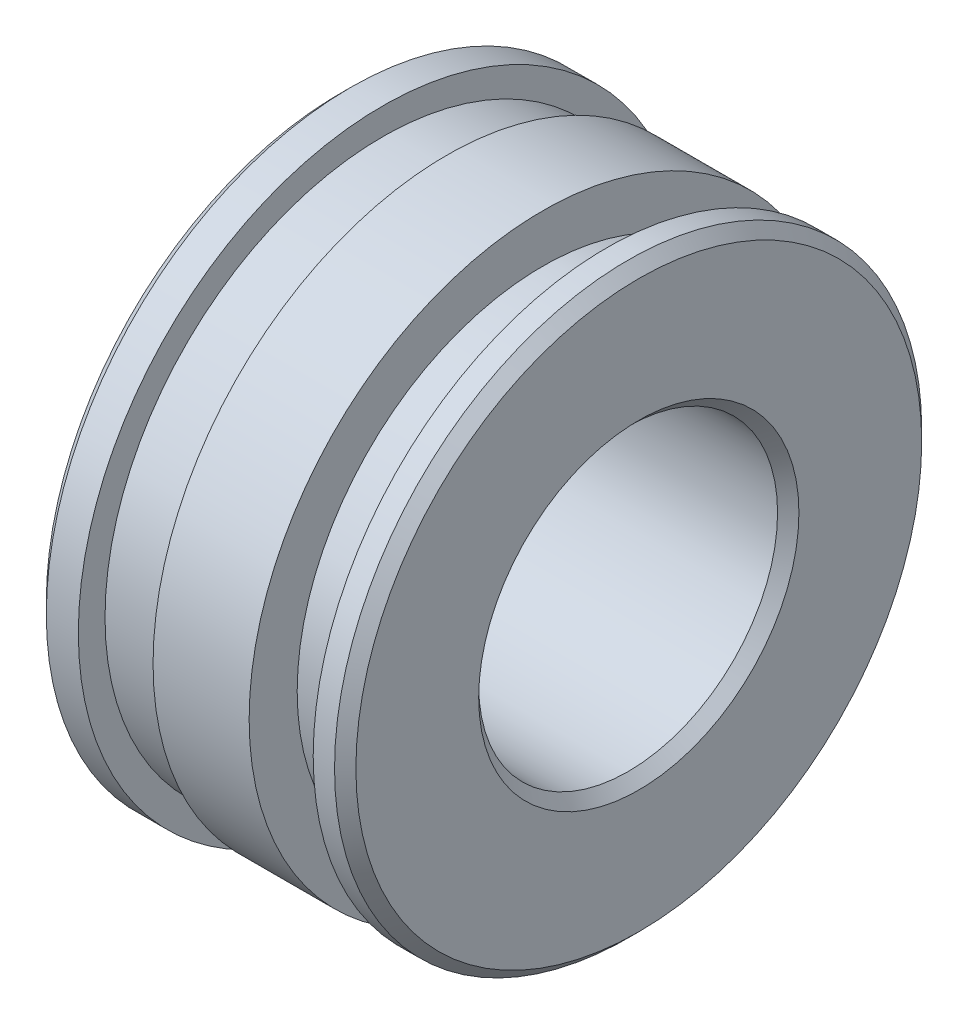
ISO-10303-21;
HEADER;
FILE_DESCRIPTION(('STEP AP214'),'2;1');
FILE_NAME('part.step','',(''),(''),'','','');
FILE_SCHEMA(('AUTOMOTIVE_DESIGN { 1 0 10303 214 1 1 1 1 }'));
ENDSEC;
DATA;
#1=APPLICATION_CONTEXT('core data for automotive mechanical design processes');
#2=APPLICATION_PROTOCOL_DEFINITION('international standard','automotive_design',2000,#1);
#3=PRODUCT_CONTEXT('',#1,'mechanical');
#4=PRODUCT('Part','Part','',(#3));
#5=PRODUCT_RELATED_PRODUCT_CATEGORY('part','',(#4));
#6=PRODUCT_DEFINITION_FORMATION('','',#4);
#7=PRODUCT_DEFINITION_CONTEXT('part definition',#1,'design');
#8=PRODUCT_DEFINITION('design','',#6,#7);
#9=PRODUCT_DEFINITION_SHAPE('','',#8);
#10=(LENGTH_UNIT() NAMED_UNIT(*) SI_UNIT(.MILLI.,.METRE.));
#11=(NAMED_UNIT(*) PLANE_ANGLE_UNIT() SI_UNIT($,.RADIAN.));
#12=(NAMED_UNIT(*) SI_UNIT($,.STERADIAN.) SOLID_ANGLE_UNIT());
#13=UNCERTAINTY_MEASURE_WITH_UNIT(LENGTH_MEASURE(1.E-05),#10,'distance_accuracy_value','');
#14=(GEOMETRIC_REPRESENTATION_CONTEXT(3) GLOBAL_UNCERTAINTY_ASSIGNED_CONTEXT((#13)) GLOBAL_UNIT_ASSIGNED_CONTEXT((#10,
#11,#12)) REPRESENTATION_CONTEXT('',''));
#15=CARTESIAN_POINT('',(0.,0.,0.));
#16=DIRECTION('',(0.,0.,1.));
#17=DIRECTION('',(1.,0.,0.));
#18=AXIS2_PLACEMENT_3D('',#15,#16,#17);
#19=CARTESIAN_POINT('',(10.,27.5,0.));
#20=DIRECTION('',(1.,0.,0.));
#21=DIRECTION('',(0.,0.,-1.));
#22=AXIS2_PLACEMENT_3D('',#19,#20,#21);
#23=PLANE('',#22);
#24=CARTESIAN_POINT('',(10.,0.,0.));
#25=DIRECTION('',(-1.,0.,0.));
#26=DIRECTION('',(0.,0.,1.));
#27=AXIS2_PLACEMENT_3D('',#24,#25,#26);
#28=CIRCLE('',#27,26.);
#29=CARTESIAN_POINT('',(10.,0.,26.));
#30=VERTEX_POINT('',#29);
#31=EDGE_CURVE('E84',#30,#30,#28,.T.);
#32=ORIENTED_EDGE('',*,*,#31,.F.);
#33=EDGE_LOOP('',(#32));
#34=FACE_BOUND('',#33,.T.);
#35=CARTESIAN_POINT('',(10.,0.,0.));
#36=DIRECTION('',(-1.,0.,0.));
#37=DIRECTION('',(0.,0.,1.));
#38=AXIS2_PLACEMENT_3D('',#35,#36,#37);
#39=CIRCLE('',#38,27.5);
#40=CARTESIAN_POINT('',(10.,0.,27.5));
#41=VERTEX_POINT('',#40);
#42=EDGE_CURVE('E63',#41,#41,#39,.T.);
#43=ORIENTED_EDGE('',*,*,#42,.T.);
#44=EDGE_LOOP('',(#43));
#45=FACE_BOUND('',#44,.T.);
#46=ADVANCED_FACE('F31',(#34,#45),#23,.F.);
#47=CARTESIAN_POINT('',(-19.2479883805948,0.,0.));
#48=DIRECTION('',(-1.,0.,0.));
#49=DIRECTION('',(0.,0.,1.));
#50=AXIS2_PLACEMENT_3D('',#47,#48,#49);
#51=CYLINDRICAL_SURFACE('',#50,27.5);
#52=ORIENTED_EDGE('',*,*,#42,.F.);
#53=EDGE_LOOP('',(#52));
#54=FACE_BOUND('',#53,.T.);
#55=CARTESIAN_POINT('',(19.,0.,0.));
#56=DIRECTION('',(-1.,0.,0.));
#57=DIRECTION('',(0.,0.,1.));
#58=AXIS2_PLACEMENT_3D('',#55,#56,#57);
#59=CIRCLE('',#58,27.5);
#60=CARTESIAN_POINT('',(19.,0.,27.5));
#61=VERTEX_POINT('',#60);
#62=EDGE_CURVE('E66',#61,#61,#59,.T.);
#63=ORIENTED_EDGE('',*,*,#62,.T.);
#64=EDGE_LOOP('',(#63));
#65=FACE_BOUND('',#64,.T.);
#66=ADVANCED_FACE('F92',(#54,#65),#51,.T.);
#67=CARTESIAN_POINT('',(19.,23.,0.));
#68=DIRECTION('',(-1.,0.,0.));
#69=DIRECTION('',(0.,0.,1.));
#70=AXIS2_PLACEMENT_3D('',#67,#68,#69);
#71=PLANE('',#70);
#72=ORIENTED_EDGE('',*,*,#62,.F.);
#73=EDGE_LOOP('',(#72));
#74=FACE_BOUND('',#73,.T.);
#75=CARTESIAN_POINT('',(19.,0.,0.));
#76=DIRECTION('',(-1.,0.,0.));
#77=DIRECTION('',(0.,0.,1.));
#78=AXIS2_PLACEMENT_3D('',#75,#76,#77);
#79=CIRCLE('',#78,23.);
#80=CARTESIAN_POINT('',(19.,0.,23.));
#81=VERTEX_POINT('',#80);
#82=EDGE_CURVE('E69',#81,#81,#79,.T.);
#83=ORIENTED_EDGE('',*,*,#82,.T.);
#84=EDGE_LOOP('',(#83));
#85=FACE_BOUND('',#84,.T.);
#86=ADVANCED_FACE('F98',(#74,#85),#71,.F.);
#87=CARTESIAN_POINT('',(-19.2479883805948,0.,0.));
#88=DIRECTION('',(-1.,0.,0.));
#89=DIRECTION('',(0.,0.,1.));
#90=AXIS2_PLACEMENT_3D('',#87,#88,#89);
#91=CYLINDRICAL_SURFACE('',#90,23.);
#92=ORIENTED_EDGE('',*,*,#82,.F.);
#93=EDGE_LOOP('',(#92));
#94=FACE_BOUND('',#93,.T.);
#95=CARTESIAN_POINT('',(25.,0.,0.));
#96=DIRECTION('',(-1.,0.,0.));
#97=DIRECTION('',(0.,0.,1.));
#98=AXIS2_PLACEMENT_3D('',#95,#96,#97);
#99=CIRCLE('',#98,23.);
#100=CARTESIAN_POINT('',(25.,0.,23.));
#101=VERTEX_POINT('',#100);
#102=EDGE_CURVE('E72',#101,#101,#99,.T.);
#103=ORIENTED_EDGE('',*,*,#102,.T.);
#104=EDGE_LOOP('',(#103));
#105=FACE_BOUND('',#104,.T.);
#106=ADVANCED_FACE('F104',(#94,#105),#91,.T.);
#107=CARTESIAN_POINT('',(25.,27.5,0.));
#108=DIRECTION('',(1.,0.,0.));
#109=DIRECTION('',(0.,0.,-1.));
#110=AXIS2_PLACEMENT_3D('',#107,#108,#109);
#111=PLANE('',#110);
#112=ORIENTED_EDGE('',*,*,#102,.F.);
#113=EDGE_LOOP('',(#112));
#114=FACE_BOUND('',#113,.T.);
#115=CARTESIAN_POINT('',(25.,0.,0.));
#116=DIRECTION('',(-1.,0.,0.));
#117=DIRECTION('',(0.,0.,1.));
#118=AXIS2_PLACEMENT_3D('',#115,#116,#117);
#119=CIRCLE('',#118,27.5);
#120=CARTESIAN_POINT('',(25.,0.,27.5));
#121=VERTEX_POINT('',#120);
#122=EDGE_CURVE('E75',#121,#121,#119,.T.);
#123=ORIENTED_EDGE('',*,*,#122,.T.);
#124=EDGE_LOOP('',(#123));
#125=FACE_BOUND('',#124,.T.);
#126=ADVANCED_FACE('F110',(#114,#125),#111,.F.);
#127=CARTESIAN_POINT('',(-19.2479883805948,0.,0.));
#128=DIRECTION('',(-1.,0.,0.));
#129=DIRECTION('',(0.,0.,1.));
#130=AXIS2_PLACEMENT_3D('',#127,#128,#129);
#131=CYLINDRICAL_SURFACE('',#130,27.5);
#132=CARTESIAN_POINT('',(27.,0.,0.));
#133=DIRECTION('',(-1.,0.,0.));
#134=DIRECTION('',(0.,0.,1.));
#135=AXIS2_PLACEMENT_3D('',#132,#133,#134);
#136=CIRCLE('',#135,27.5);
#137=CARTESIAN_POINT('',(27.,0.,27.5));
#138=VERTEX_POINT('',#137);
#139=EDGE_CURVE('E46',#138,#138,#136,.T.);
#140=ORIENTED_EDGE('',*,*,#139,.T.);
#141=EDGE_LOOP('',(#140));
#142=FACE_BOUND('',#141,.T.);
#143=ORIENTED_EDGE('',*,*,#122,.F.);
#144=EDGE_LOOP('',(#143));
#145=FACE_BOUND('',#144,.T.);
#146=ADVANCED_FACE('F116',(#142,#145),#131,.T.);
#147=CARTESIAN_POINT('',(28.,14.,0.));
#148=DIRECTION('',(-1.,0.,0.));
#149=DIRECTION('',(0.,0.,1.));
#150=AXIS2_PLACEMENT_3D('',#147,#148,#149);
#151=PLANE('',#150);
#152=CARTESIAN_POINT('',(28.,0.,0.));
#153=DIRECTION('',(-1.,0.,0.));
#154=DIRECTION('',(0.,0.,1.));
#155=AXIS2_PLACEMENT_3D('',#152,#153,#154);
#156=CIRCLE('',#155,15.);
#157=CARTESIAN_POINT('',(28.,0.,15.));
#158=VERTEX_POINT('',#157);
#159=EDGE_CURVE('E57',#158,#158,#156,.T.);
#160=ORIENTED_EDGE('',*,*,#159,.T.);
#161=EDGE_LOOP('',(#160));
#162=FACE_BOUND('',#161,.T.);
#163=CARTESIAN_POINT('',(28.,0.,0.));
#164=DIRECTION('',(-1.,0.,0.));
#165=DIRECTION('',(0.,0.,1.));
#166=AXIS2_PLACEMENT_3D('',#163,#164,#165);
#167=CIRCLE('',#166,26.5);
#168=CARTESIAN_POINT('',(28.,0.,26.5));
#169=VERTEX_POINT('',#168);
#170=EDGE_CURVE('E60',#169,#169,#167,.F.);
#171=ORIENTED_EDGE('',*,*,#170,.T.);
#172=EDGE_LOOP('',(#171));
#173=FACE_BOUND('',#172,.T.);
#174=ADVANCED_FACE('F121',(#162,#173),#151,.F.);
#175=CARTESIAN_POINT('',(-19.2479883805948,0.,0.));
#176=DIRECTION('',(-1.,0.,0.));
#177=DIRECTION('',(0.,0.,1.));
#178=AXIS2_PLACEMENT_3D('',#175,#176,#177);
#179=CYLINDRICAL_SURFACE('',#178,14.);
#180=CARTESIAN_POINT('',(27.,0.,0.));
#181=DIRECTION('',(-1.,0.,0.));
#182=DIRECTION('',(0.,0.,1.));
#183=AXIS2_PLACEMENT_3D('',#180,#181,#182);
#184=CIRCLE('',#183,14.);
#185=CARTESIAN_POINT('',(27.,0.,14.));
#186=VERTEX_POINT('',#185);
#187=EDGE_CURVE('E51',#186,#186,#184,.F.);
#188=ORIENTED_EDGE('',*,*,#187,.T.);
#189=EDGE_LOOP('',(#188));
#190=FACE_BOUND('',#189,.T.);
#191=CARTESIAN_POINT('',(0.999999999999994,0.,0.));
#192=DIRECTION('',(1.,0.,0.));
#193=DIRECTION('',(0.,0.,-1.));
#194=AXIS2_PLACEMENT_3D('',#191,#192,#193);
#195=CIRCLE('',#194,14.);
#196=CARTESIAN_POINT('',(0.999999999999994,0.,-14.));
#197=VERTEX_POINT('',#196);
#198=EDGE_CURVE('E54',#197,#197,#195,.F.);
#199=ORIENTED_EDGE('',*,*,#198,.T.);
#200=EDGE_LOOP('',(#199));
#201=FACE_BOUND('',#200,.T.);
#202=ADVANCED_FACE('F127',(#190,#201),#179,.F.);
#203=CARTESIAN_POINT('',(0.,28.5,0.));
#204=DIRECTION('',(1.,0.,0.));
#205=DIRECTION('',(0.,0.,-1.));
#206=AXIS2_PLACEMENT_3D('',#203,#204,#205);
#207=PLANE('',#206);
#208=CARTESIAN_POINT('',(0.,0.,0.));
#209=DIRECTION('',(1.,0.,0.));
#210=DIRECTION('',(0.,0.,-1.));
#211=AXIS2_PLACEMENT_3D('',#208,#209,#210);
#212=CIRCLE('',#211,27.5);
#213=CARTESIAN_POINT('',(0.,0.,-27.5));
#214=VERTEX_POINT('',#213);
#215=EDGE_CURVE('E38',#214,#214,#212,.F.);
#216=ORIENTED_EDGE('',*,*,#215,.T.);
#217=EDGE_LOOP('',(#216));
#218=FACE_BOUND('',#217,.T.);
#219=CARTESIAN_POINT('',(0.,0.,0.));
#220=DIRECTION('',(1.,0.,0.));
#221=DIRECTION('',(0.,0.,-1.));
#222=AXIS2_PLACEMENT_3D('',#219,#220,#221);
#223=CIRCLE('',#222,15.);
#224=CARTESIAN_POINT('',(0.,0.,-15.));
#225=VERTEX_POINT('',#224);
#226=EDGE_CURVE('E42',#225,#225,#223,.T.);
#227=ORIENTED_EDGE('',*,*,#226,.T.);
#228=EDGE_LOOP('',(#227));
#229=FACE_BOUND('',#228,.T.);
#230=ADVANCED_FACE('F154',(#218,#229),#207,.F.);
#231=CARTESIAN_POINT('',(-19.2479883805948,0.,0.));
#232=DIRECTION('',(-1.,0.,0.));
#233=DIRECTION('',(0.,0.,1.));
#234=AXIS2_PLACEMENT_3D('',#231,#232,#233);
#235=CYLINDRICAL_SURFACE('',#234,28.5);
#236=CARTESIAN_POINT('',(0.999999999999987,0.,0.));
#237=DIRECTION('',(1.,0.,0.));
#238=DIRECTION('',(0.,0.,-1.));
#239=AXIS2_PLACEMENT_3D('',#236,#237,#238);
#240=CIRCLE('',#239,28.5);
#241=CARTESIAN_POINT('',(0.999999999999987,0.,-28.5));
#242=VERTEX_POINT('',#241);
#243=EDGE_CURVE('E10',#242,#242,#240,.T.);
#244=ORIENTED_EDGE('',*,*,#243,.T.);
#245=EDGE_LOOP('',(#244));
#246=FACE_BOUND('',#245,.T.);
#247=CARTESIAN_POINT('',(4.,0.,0.));
#248=DIRECTION('',(-1.,0.,0.));
#249=DIRECTION('',(0.,0.,1.));
#250=AXIS2_PLACEMENT_3D('',#247,#248,#249);
#251=CIRCLE('',#250,28.5);
#252=CARTESIAN_POINT('',(4.,0.,28.5));
#253=VERTEX_POINT('',#252);
#254=EDGE_CURVE('E78',#253,#253,#251,.T.);
#255=ORIENTED_EDGE('',*,*,#254,.T.);
#256=EDGE_LOOP('',(#255));
#257=FACE_BOUND('',#256,.T.);
#258=ADVANCED_FACE('F159',(#246,#257),#235,.T.);
#259=CARTESIAN_POINT('',(4.,26.,0.));
#260=DIRECTION('',(-1.,0.,0.));
#261=DIRECTION('',(0.,0.,1.));
#262=AXIS2_PLACEMENT_3D('',#259,#260,#261);
#263=PLANE('',#262);
#264=ORIENTED_EDGE('',*,*,#254,.F.);
#265=EDGE_LOOP('',(#264));
#266=FACE_BOUND('',#265,.T.);
#267=CARTESIAN_POINT('',(4.,0.,0.));
#268=DIRECTION('',(-1.,0.,0.));
#269=DIRECTION('',(0.,0.,1.));
#270=AXIS2_PLACEMENT_3D('',#267,#268,#269);
#271=CIRCLE('',#270,26.);
#272=CARTESIAN_POINT('',(4.,0.,26.));
#273=VERTEX_POINT('',#272);
#274=EDGE_CURVE('E81',#273,#273,#271,.T.);
#275=ORIENTED_EDGE('',*,*,#274,.T.);
#276=EDGE_LOOP('',(#275));
#277=FACE_BOUND('',#276,.T.);
#278=ADVANCED_FACE('F164',(#266,#277),#263,.F.);
#279=CARTESIAN_POINT('',(-19.2479883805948,0.,0.));
#280=DIRECTION('',(-1.,0.,0.));
#281=DIRECTION('',(0.,0.,1.));
#282=AXIS2_PLACEMENT_3D('',#279,#280,#281);
#283=CYLINDRICAL_SURFACE('',#282,26.);
#284=ORIENTED_EDGE('',*,*,#274,.F.);
#285=EDGE_LOOP('',(#284));
#286=FACE_BOUND('',#285,.T.);
#287=ORIENTED_EDGE('',*,*,#31,.T.);
#288=EDGE_LOOP('',(#287));
#289=FACE_BOUND('',#288,.T.);
#290=ADVANCED_FACE('F88',(#286,#289),#283,.T.);
#291=CARTESIAN_POINT('',(28.,0.,0.));
#292=DIRECTION('',(1.,0.,0.));
#293=DIRECTION('',(0.,0.,-1.));
#294=AXIS2_PLACEMENT_3D('',#291,#292,#293);
#295=CONICAL_SURFACE('',#294,15.,0.785398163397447);
#296=ORIENTED_EDGE('',*,*,#187,.F.);
#297=EDGE_LOOP('',(#296));
#298=FACE_BOUND('',#297,.T.);
#299=ORIENTED_EDGE('',*,*,#159,.F.);
#300=EDGE_LOOP('',(#299));
#301=FACE_BOUND('',#300,.T.);
#302=ADVANCED_FACE('F132',(#298,#301),#295,.F.);
#303=CARTESIAN_POINT('',(27.,0.,0.));
#304=DIRECTION('',(-1.,0.,0.));
#305=DIRECTION('',(0.,0.,1.));
#306=AXIS2_PLACEMENT_3D('',#303,#304,#305);
#307=CONICAL_SURFACE('',#306,27.5,0.785398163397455);
#308=ORIENTED_EDGE('',*,*,#170,.F.);
#309=EDGE_LOOP('',(#308));
#310=FACE_BOUND('',#309,.T.);
#311=ORIENTED_EDGE('',*,*,#139,.F.);
#312=EDGE_LOOP('',(#311));
#313=FACE_BOUND('',#312,.T.);
#314=ADVANCED_FACE('F135',(#310,#313),#307,.T.);
#315=CARTESIAN_POINT('',(0.,0.,0.));
#316=DIRECTION('',(1.,0.,0.));
#317=DIRECTION('',(0.,0.,-1.));
#318=AXIS2_PLACEMENT_3D('',#315,#316,#317);
#319=CONICAL_SURFACE('',#318,27.5,0.785398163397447);
#320=ORIENTED_EDGE('',*,*,#243,.F.);
#321=EDGE_LOOP('',(#320));
#322=FACE_BOUND('',#321,.T.);
#323=ORIENTED_EDGE('',*,*,#215,.F.);
#324=EDGE_LOOP('',(#323));
#325=FACE_BOUND('',#324,.T.);
#326=ADVANCED_FACE('F138',(#322,#325),#319,.T.);
#327=CARTESIAN_POINT('',(0.999999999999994,0.,0.));
#328=DIRECTION('',(-1.,0.,0.));
#329=DIRECTION('',(0.,0.,1.));
#330=AXIS2_PLACEMENT_3D('',#327,#328,#329);
#331=CONICAL_SURFACE('',#330,14.,0.785398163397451);
#332=ORIENTED_EDGE('',*,*,#226,.F.);
#333=EDGE_LOOP('',(#332));
#334=FACE_BOUND('',#333,.T.);
#335=ORIENTED_EDGE('',*,*,#198,.F.);
#336=EDGE_LOOP('',(#335));
#337=FACE_BOUND('',#336,.T.);
#338=ADVANCED_FACE('F33',(#334,#337),#331,.F.);
#339=CLOSED_SHELL('',(#46,#66,#86,#106,#126,#146,#174,#202,#230,#258,#278,#290,#302,#314,#326,#338));
#340=MANIFOLD_SOLID_BREP('B2',#339);
#341=ADVANCED_BREP_SHAPE_REPRESENTATION('',(#18,#340),#14);
#342=SHAPE_DEFINITION_REPRESENTATION(#9,#341);
ENDSEC;
END-ISO-10303-21;
